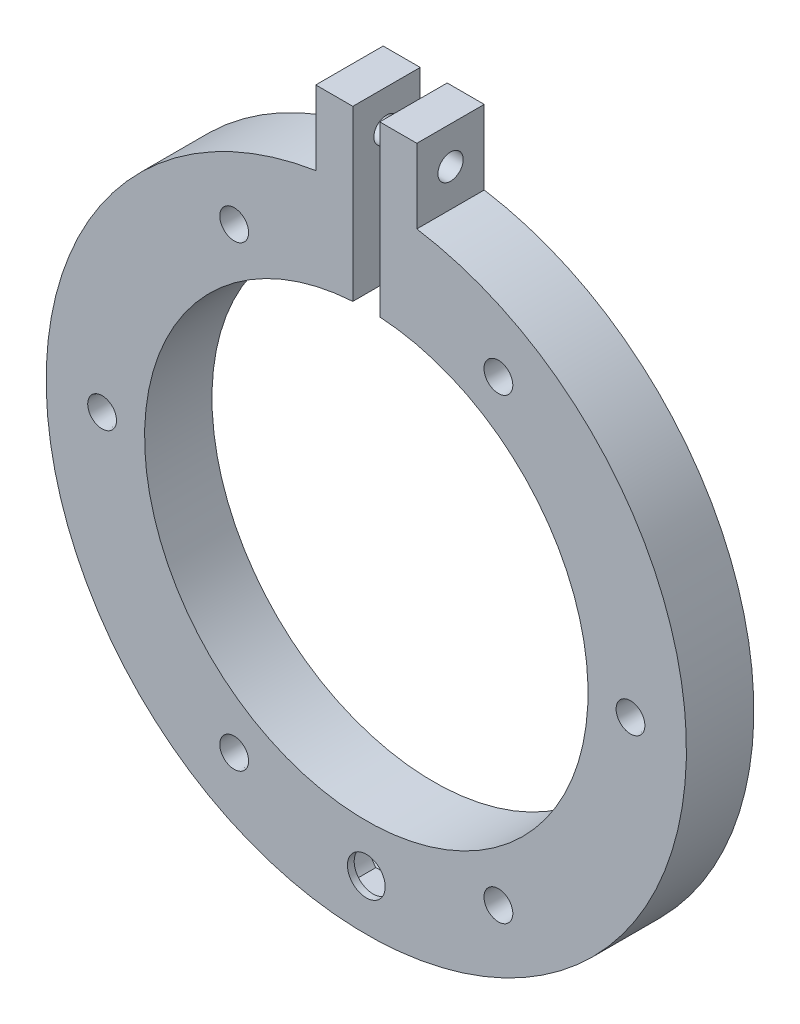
ISO-10303-21;
HEADER;
FILE_DESCRIPTION(('STEP AP214'),'2;1');
FILE_NAME('part.step','',(''),(''),'','','');
FILE_SCHEMA(('AUTOMOTIVE_DESIGN { 1 0 10303 214 1 1 1 1 }'));
ENDSEC;
DATA;
#1=APPLICATION_CONTEXT('core data for automotive mechanical design processes');
#2=APPLICATION_PROTOCOL_DEFINITION('international standard','automotive_design',2000,#1);
#3=PRODUCT_CONTEXT('',#1,'mechanical');
#4=PRODUCT('Part','Part','',(#3));
#5=PRODUCT_RELATED_PRODUCT_CATEGORY('part','',(#4));
#6=PRODUCT_DEFINITION_FORMATION('','',#4);
#7=PRODUCT_DEFINITION_CONTEXT('part definition',#1,'design');
#8=PRODUCT_DEFINITION('design','',#6,#7);
#9=PRODUCT_DEFINITION_SHAPE('','',#8);
#10=(LENGTH_UNIT() NAMED_UNIT(*) SI_UNIT(.MILLI.,.METRE.));
#11=(NAMED_UNIT(*) PLANE_ANGLE_UNIT() SI_UNIT($,.RADIAN.));
#12=(NAMED_UNIT(*) SI_UNIT($,.STERADIAN.) SOLID_ANGLE_UNIT());
#13=UNCERTAINTY_MEASURE_WITH_UNIT(LENGTH_MEASURE(1.E-05),#10,'distance_accuracy_value','');
#14=(GEOMETRIC_REPRESENTATION_CONTEXT(3) GLOBAL_UNCERTAINTY_ASSIGNED_CONTEXT((#13)) GLOBAL_UNIT_ASSIGNED_CONTEXT((#10,
#11,#12)) REPRESENTATION_CONTEXT('',''));
#15=CARTESIAN_POINT('',(0.,0.,0.));
#16=DIRECTION('',(0.,0.,1.));
#17=DIRECTION('',(1.,0.,0.));
#18=AXIS2_PLACEMENT_3D('',#15,#16,#17);
#19=CARTESIAN_POINT('',(0.,0.,12.7));
#20=DIRECTION('',(0.,0.,-1.));
#21=DIRECTION('',(-1.,0.,0.));
#22=AXIS2_PLACEMENT_3D('',#19,#20,#21);
#23=CYLINDRICAL_SURFACE('',#22,60.325);
#24=CARTESIAN_POINT('',(0.,0.,0.));
#25=DIRECTION('',(0.,0.,1.));
#26=DIRECTION('',(1.,0.,0.));
#27=AXIS2_PLACEMENT_3D('',#24,#25,#26);
#28=CIRCLE('',#27,60.325);
#29=CARTESIAN_POINT('',(-9.525,59.5682801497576,0.));
#30=VERTEX_POINT('',#29);
#31=CARTESIAN_POINT('',(9.525,59.5682801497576,0.));
#32=VERTEX_POINT('',#31);
#33=EDGE_CURVE('E297',#30,#32,#28,.T.);
#34=ORIENTED_EDGE('',*,*,#33,.T.);
#35=DIRECTION('',(0.,0.,-1.));
#36=VECTOR('',#35,1.);
#37=CARTESIAN_POINT('',(9.525,59.5682801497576,12.7));
#38=LINE('',#37,#36);
#39=CARTESIAN_POINT('',(9.525,59.5682801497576,12.7));
#40=VERTEX_POINT('',#39);
#41=EDGE_CURVE('E301',#32,#40,#38,.F.);
#42=ORIENTED_EDGE('',*,*,#41,.T.);
#43=CARTESIAN_POINT('',(0.,0.,12.7));
#44=DIRECTION('',(0.,0.,1.));
#45=DIRECTION('',(1.,0.,0.));
#46=AXIS2_PLACEMENT_3D('',#43,#44,#45);
#47=CIRCLE('',#46,60.325);
#48=CARTESIAN_POINT('',(-9.525,59.5682801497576,12.7));
#49=VERTEX_POINT('',#48);
#50=EDGE_CURVE('E307',#49,#40,#47,.T.);
#51=ORIENTED_EDGE('',*,*,#50,.F.);
#52=DIRECTION('',(0.,0.,-1.));
#53=VECTOR('',#52,1.);
#54=CARTESIAN_POINT('',(-9.525,59.5682801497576,12.7));
#55=LINE('',#54,#53);
#56=EDGE_CURVE('E304',#49,#30,#55,.T.);
#57=ORIENTED_EDGE('',*,*,#56,.T.);
#58=EDGE_LOOP('',(#34,#42,#51,#57));
#59=FACE_BOUND('',#58,.T.);
#60=CARTESIAN_POINT('',(0.,-60.325,1.00943066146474));
#61=CARTESIAN_POINT('',(0.142605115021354,-60.3249992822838,1.00943696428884));
#62=CARTESIAN_POINT('',(0.285312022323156,-60.3244889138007,1.02148056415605));
#63=CARTESIAN_POINT('',(0.566790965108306,-60.3225020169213,1.06935514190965));
#64=CARTESIAN_POINT('',(0.705558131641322,-60.3210243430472,1.10521432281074));
#65=CARTESIAN_POINT('',(0.97503923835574,-60.3172701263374,1.19969325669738));
#66=CARTESIAN_POINT('',(1.10575717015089,-60.3149939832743,1.25830162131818));
#67=CARTESIAN_POINT('',(1.35546341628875,-60.3098993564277,1.39659826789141));
#68=CARTESIAN_POINT('',(1.47445453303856,-60.3070810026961,1.47628149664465));
#69=CARTESIAN_POINT('',(1.69745564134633,-60.3012167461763,1.65453423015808));
#70=CARTESIAN_POINT('',(1.80145573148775,-60.2981706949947,1.75311611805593));
#71=CARTESIAN_POINT('',(1.99143852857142,-60.2921956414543,1.96634390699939));
#72=CARTESIAN_POINT('',(2.07742050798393,-60.2892666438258,2.08099045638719));
#73=CARTESIAN_POINT('',(2.22895045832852,-60.2838550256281,2.3231409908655));
#74=CARTESIAN_POINT('',(2.29449118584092,-60.2813725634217,2.4506495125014));
#75=CARTESIAN_POINT('',(2.40323155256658,-60.2771356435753,2.71487245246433));
#76=CARTESIAN_POINT('',(2.44643132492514,-60.2753811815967,2.85158681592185));
#77=CARTESIAN_POINT('',(2.50923866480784,-60.2727993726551,3.13025393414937));
#78=CARTESIAN_POINT('',(2.52886033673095,-60.2719714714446,3.27220350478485));
#79=CARTESIAN_POINT('',(2.54399798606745,-60.2713344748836,3.55738391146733));
#80=CARTESIAN_POINT('',(2.53951411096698,-60.2715253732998,3.70061473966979));
#81=CARTESIAN_POINT('',(2.50657974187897,-60.2729039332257,3.98419610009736));
#82=CARTESIAN_POINT('',(2.4781444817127,-60.2740909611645,4.12454840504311));
#83=CARTESIAN_POINT('',(2.39813810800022,-60.2773269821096,4.39848569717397));
#84=CARTESIAN_POINT('',(2.34656691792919,-60.2793759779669,4.53207066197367));
#85=CARTESIAN_POINT('',(2.22173515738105,-60.2841057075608,4.78873038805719));
#86=CARTESIAN_POINT('',(2.14846762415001,-60.2867866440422,4.91180175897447));
#87=CARTESIAN_POINT('',(1.98232807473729,-60.2924778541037,5.14390364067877));
#88=CARTESIAN_POINT('',(1.88945596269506,-60.295488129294,5.25293408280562));
#89=CARTESIAN_POINT('',(1.68665749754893,-60.3015015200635,5.4539478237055));
#90=CARTESIAN_POINT('',(1.57671794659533,-60.3045046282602,5.54591780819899));
#91=CARTESIAN_POINT('',(1.34295183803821,-60.3101629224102,5.71009739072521));
#92=CARTESIAN_POINT('',(1.21912527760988,-60.3128181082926,5.78230698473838));
#93=CARTESIAN_POINT('',(0.961092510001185,-60.3174813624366,5.90491465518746));
#94=CARTESIAN_POINT('',(0.826886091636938,-60.3194894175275,5.95531228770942));
#95=CARTESIAN_POINT('',(0.551906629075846,-60.322631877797,6.03285682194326));
#96=CARTESIAN_POINT('',(0.411133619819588,-60.3237662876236,6.06000384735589));
#97=CARTESIAN_POINT('',(0.127132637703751,-60.3250329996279,6.0902601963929));
#98=CARTESIAN_POINT('',(-0.0160933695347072,-60.3251660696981,6.09338793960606));
#99=CARTESIAN_POINT('',(-0.301036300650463,-60.3244171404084,6.07556497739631));
#100=CARTESIAN_POINT('',(-0.442753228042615,-60.3235351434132,6.05461432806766));
#101=CARTESIAN_POINT('',(-0.72060368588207,-60.3208559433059,5.98924453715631));
#102=CARTESIAN_POINT('',(-0.856739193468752,-60.319059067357,5.94483378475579));
#103=CARTESIAN_POINT('',(-1.11962324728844,-60.3147524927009,5.83381295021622));
#104=CARTESIAN_POINT('',(-1.24637175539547,-60.3122427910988,5.76720277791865));
#105=CARTESIAN_POINT('',(-1.48696856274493,-60.3067911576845,5.61362663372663));
#106=CARTESIAN_POINT('',(-1.60080895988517,-60.3038489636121,5.52664829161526));
#107=CARTESIAN_POINT('',(-1.81227862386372,-60.2978646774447,5.33482291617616));
#108=CARTESIAN_POINT('',(-1.90990781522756,-60.2948225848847,5.22997579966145));
#109=CARTESIAN_POINT('',(-2.08624552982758,-60.2889792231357,5.00530999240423));
#110=CARTESIAN_POINT('',(-2.1649421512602,-60.286178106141,4.8854819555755));
#111=CARTESIAN_POINT('',(-2.30109948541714,-60.2811349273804,4.63430317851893));
#112=CARTESIAN_POINT('',(-2.35856027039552,-60.2788928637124,4.50295247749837));
#113=CARTESIAN_POINT('',(-2.45059401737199,-60.2752216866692,4.23250135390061));
#114=CARTESIAN_POINT('',(-2.48517461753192,-60.2737923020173,4.09340353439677));
#115=CARTESIAN_POINT('',(-2.53049138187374,-60.2719068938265,3.81137005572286));
#116=CARTESIAN_POINT('',(-2.54122762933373,-60.2714508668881,3.66843440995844));
#117=CARTESIAN_POINT('',(-2.53855005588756,-60.2715636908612,3.38290133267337));
#118=CARTESIAN_POINT('',(-2.52515497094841,-60.2721317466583,3.24030372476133));
#119=CARTESIAN_POINT('',(-2.47463362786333,-60.2742270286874,2.95938355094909));
#120=CARTESIAN_POINT('',(-2.43750732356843,-60.2757542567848,2.82106099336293));
#121=CARTESIAN_POINT('',(-2.3405809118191,-60.2795955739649,2.55261256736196));
#122=CARTESIAN_POINT('',(-2.28078052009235,-60.2819096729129,2.42248680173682));
#123=CARTESIAN_POINT('',(-2.14020742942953,-60.2870638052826,2.17412242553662));
#124=CARTESIAN_POINT('',(-2.05943542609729,-60.2899038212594,2.05588342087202));
#125=CARTESIAN_POINT('',(-1.87914753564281,-60.2957921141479,1.83455706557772));
#126=CARTESIAN_POINT('',(-1.77961915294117,-60.2988405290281,1.73147989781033));
#127=CARTESIAN_POINT('',(-1.56464135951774,-60.3048012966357,1.54346698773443));
#128=CARTESIAN_POINT('',(-1.44918802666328,-60.3077136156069,1.45853572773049));
#129=CARTESIAN_POINT('',(-1.20556779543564,-60.3130755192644,1.30919738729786));
#130=CARTESIAN_POINT('',(-1.07739059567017,-60.3155247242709,1.24480711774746));
#131=CARTESIAN_POINT('',(-0.812131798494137,-60.3196782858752,1.13853671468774));
#132=CARTESIAN_POINT('',(-0.67506098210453,-60.3213835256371,1.09662987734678));
#133=CARTESIAN_POINT('',(-0.447609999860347,-60.3234038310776,1.04755982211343));
#134=CARTESIAN_POINT('',(-0.358704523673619,-60.3239997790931,1.03327952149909));
#135=CARTESIAN_POINT('',(-0.179879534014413,-60.324798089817,1.01421295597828));
#136=CARTESIAN_POINT('',(-0.08996002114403,-60.3250004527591,1.00942668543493));
#137=CARTESIAN_POINT('',(0.,-60.325,1.00943066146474));
#138=B_SPLINE_CURVE_WITH_KNOTS('',3,(#60,#61,#62,#63,#64,#65,#66,#67,#68,#69,#70,#71,#72,#73,
#74,#75,#76,#77,#78,#79,#80,#81,#82,#83,#84,#85,#86,#87,#88,#89,#90,#91,#92,#93,#94,#95,#96,#97,
#98,#99,#100,#101,#102,#103,#104,#105,#106,#107,#108,#109,#110,#111,#112,#113,#114,#115,#116,
#117,#118,#119,#120,#121,#122,#123,#124,#125,#126,#127,#128,#129,#130,#131,#132,#133,#134,#135,
#136,#137),.UNSPECIFIED.,.T.,.F.,(4,2,2,2,2,2,2,2,2,2,2,2,2,2,2,2,2,2,2,2,2,2,2,2,2,2,2,2,2,2,2,
2,2,2,2,2,2,2,4),(0.,0.427486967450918,0.855481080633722,1.283261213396,1.71093886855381,
2.13889771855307,2.56687384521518,2.99500145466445,3.42312651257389,3.85099533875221,
4.27886154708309,4.70645582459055,5.13405151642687,5.56178458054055,5.98951973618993,
6.41758731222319,6.84565497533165,7.27373135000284,7.70180544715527,8.12955123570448,
8.55729602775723,8.98488796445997,9.41248163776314,9.84033567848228,10.2681917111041,
10.6963160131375,11.1244388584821,11.5524187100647,11.9803970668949,12.4080432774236,
12.835690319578,13.263342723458,13.6909809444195,14.1189050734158,14.5469347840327,
14.9753139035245,15.4031830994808,15.672856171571,15.9425290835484),.UNSPECIFIED.);
#139=CARTESIAN_POINT('',(0.,-60.325,1.00943066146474));
#140=VERTEX_POINT('',#139);
#141=EDGE_CURVE('E195',#140,#140,#138,.T.);
#142=ORIENTED_EDGE('',*,*,#141,.F.);
#143=EDGE_LOOP('',(#142));
#144=FACE_BOUND('',#143,.T.);
#145=ADVANCED_FACE('F35',(#59,#144),#23,.T.);
#146=CARTESIAN_POINT('',(0.,0.,6.35));
#147=DIRECTION('',(0.,0.,-1.));
#148=DIRECTION('',(-1.,0.,0.));
#149=AXIS2_PLACEMENT_3D('',#146,#147,#148);
#150=CYLINDRICAL_SURFACE('',#149,57.15);
#151=CARTESIAN_POINT('',(0.,0.,6.35));
#152=DIRECTION('',(0.,0.,-1.));
#153=DIRECTION('',(-1.,0.,0.));
#154=AXIS2_PLACEMENT_3D('',#151,#152,#153);
#155=CIRCLE('',#154,57.15);
#156=CARTESIAN_POINT('',(2.54,57.0935276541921,6.35));
#157=VERTEX_POINT('',#156);
#158=CARTESIAN_POINT('',(-2.54,57.0935276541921,6.35));
#159=VERTEX_POINT('',#158);
#160=EDGE_CURVE('E380',#157,#159,#155,.T.);
#161=ORIENTED_EDGE('',*,*,#160,.F.);
#162=DIRECTION('',(0.,0.,-1.));
#163=VECTOR('',#162,1.);
#164=CARTESIAN_POINT('',(2.54,57.0935276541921,6.35));
#165=LINE('',#164,#163);
#166=CARTESIAN_POINT('',(2.54,57.0935276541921,0.));
#167=VERTEX_POINT('',#166);
#168=EDGE_CURVE('E11',#167,#157,#165,.F.);
#169=ORIENTED_EDGE('',*,*,#168,.F.);
#170=CARTESIAN_POINT('',(0.,0.,0.));
#171=DIRECTION('',(0.,0.,-1.));
#172=DIRECTION('',(-1.,0.,0.));
#173=AXIS2_PLACEMENT_3D('',#170,#171,#172);
#174=CIRCLE('',#173,57.15);
#175=CARTESIAN_POINT('',(-2.54,57.0935276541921,0.));
#176=VERTEX_POINT('',#175);
#177=EDGE_CURVE('E390',#167,#176,#174,.T.);
#178=ORIENTED_EDGE('',*,*,#177,.T.);
#179=DIRECTION('',(0.,0.,-1.));
#180=VECTOR('',#179,1.);
#181=CARTESIAN_POINT('',(-2.54,57.0935276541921,6.35));
#182=LINE('',#181,#180);
#183=EDGE_CURVE('E388',#159,#176,#182,.T.);
#184=ORIENTED_EDGE('',*,*,#183,.F.);
#185=EDGE_LOOP('',(#161,#169,#178,#184));
#186=FACE_BOUND('',#185,.T.);
#187=CARTESIAN_POINT('',(0.,-57.15,1.00943066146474));
#188=CARTESIAN_POINT('',(-0.142597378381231,-57.1499992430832,1.0094369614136));
#189=CARTESIAN_POINT('',(-0.285296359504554,-57.1494605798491,1.02147925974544));
#190=CARTESIAN_POINT('',(-0.566759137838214,-57.1473635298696,1.06934836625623));
#191=CARTESIAN_POINT('',(-0.705518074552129,-57.1458039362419,1.1052033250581));
#192=CARTESIAN_POINT('',(-0.974982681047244,-57.1418415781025,1.19967038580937));
#193=CARTESIAN_POINT('',(-1.10569236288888,-57.1394392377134,1.25827104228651));
#194=CARTESIAN_POINT('',(-1.3553837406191,-57.1340620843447,1.39654883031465));
#195=CARTESIAN_POINT('',(-1.47436822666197,-57.1310874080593,1.47622093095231));
#196=CARTESIAN_POINT('',(-1.69736607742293,-57.1248975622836,1.65445421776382));
#197=CARTESIAN_POINT('',(-1.80136859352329,-57.1216822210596,1.75302897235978));
#198=CARTESIAN_POINT('',(-1.99135802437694,-57.1153749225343,1.96624290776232));
#199=CARTESIAN_POINT('',(-2.07734420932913,-57.1122829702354,2.08088273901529));
#200=CARTESIAN_POINT('',(-2.22888772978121,-57.1065699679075,2.32302654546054));
#201=CARTESIAN_POINT('',(-2.29443694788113,-57.1039491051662,2.450535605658));
#202=CARTESIAN_POINT('',(-2.40319364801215,-57.0994758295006,2.71476248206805));
#203=CARTESIAN_POINT('',(-2.44640127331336,-57.0976234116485,2.8514802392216));
#204=CARTESIAN_POINT('',(-2.50922058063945,-57.0948974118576,3.13014697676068));
#205=CARTESIAN_POINT('',(-2.52884798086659,-57.0940231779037,3.27209240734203));
#206=CARTESIAN_POINT('',(-2.54399816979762,-57.0933501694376,3.5572657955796));
#207=CARTESIAN_POINT('',(-2.53952111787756,-57.0935513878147,3.7004937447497));
#208=CARTESIAN_POINT('',(-2.50660261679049,-57.0950059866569,3.98405970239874));
#209=CARTESIAN_POINT('',(-2.47817814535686,-57.0962586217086,4.12439968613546));
#210=CARTESIAN_POINT('',(-2.39819797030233,-57.0996736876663,4.39831414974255));
#211=CARTESIAN_POINT('',(-2.34664218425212,-57.1018361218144,4.53188860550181));
#212=CARTESIAN_POINT('',(-2.22184343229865,-57.1068279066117,4.78853504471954));
#213=CARTESIAN_POINT('',(-2.14859271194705,-57.1096574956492,4.91160325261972));
#214=CARTESIAN_POINT('',(-1.98248908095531,-57.1156644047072,5.14370242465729));
#215=CARTESIAN_POINT('',(-1.88963606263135,-57.1188417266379,5.25273331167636));
#216=CARTESIAN_POINT('',(-1.68686771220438,-57.1251892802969,5.4537616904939));
#217=CARTESIAN_POINT('',(-1.57693767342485,-57.1283595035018,5.54574434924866));
#218=CARTESIAN_POINT('',(-1.34318753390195,-57.1343328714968,5.70995095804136));
#219=CARTESIAN_POINT('',(-1.2193674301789,-57.1371360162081,5.78217490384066));
#220=CARTESIAN_POINT('',(-0.961343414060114,-57.1420593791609,5.9048124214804));
#221=CARTESIAN_POINT('',(-0.827139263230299,-57.1441795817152,5.95522549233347));
#222=CARTESIAN_POINT('',(-0.552160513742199,-57.1474978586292,6.03280059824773));
#223=CARTESIAN_POINT('',(-0.411385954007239,-57.1486959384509,6.0599627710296));
#224=CARTESIAN_POINT('',(-0.12739126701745,-57.1500342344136,6.09024679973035));
#225=CARTESIAN_POINT('',(0.0158266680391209,-57.1501753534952,6.09338917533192));
#226=CARTESIAN_POINT('',(0.300755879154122,-57.1493862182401,6.07559793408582));
#227=CARTESIAN_POINT('',(0.442467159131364,-57.1484559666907,6.05466437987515));
#228=CARTESIAN_POINT('',(0.720302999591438,-57.1456294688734,5.989332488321));
#229=CARTESIAN_POINT('',(0.856429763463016,-57.1437336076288,5.94494350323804));
#230=CARTESIAN_POINT('',(1.11930024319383,-57.1391893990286,5.83397027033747));
#231=CARTESIAN_POINT('',(1.24604391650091,-57.1365410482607,5.76738592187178));
#232=CARTESIAN_POINT('',(1.48664472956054,-57.1307876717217,5.6138594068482));
#233=CARTESIAN_POINT('',(1.60049307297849,-57.1276823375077,5.52690346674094));
#234=CARTESIAN_POINT('',(1.81198308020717,-57.121365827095,5.33512228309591));
#235=CARTESIAN_POINT('',(1.90962466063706,-57.1181546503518,5.23029694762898));
#236=CARTESIAN_POINT('',(2.0859983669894,-57.111985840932,5.00566441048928));
#237=CARTESIAN_POINT('',(2.16471722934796,-57.1090283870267,4.88584678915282));
#238=CARTESIAN_POINT('',(2.30092032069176,-57.1037033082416,4.63468364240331));
#239=CARTESIAN_POINT('',(2.35840462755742,-57.1013356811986,4.50333815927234));
#240=CARTESIAN_POINT('',(2.45048366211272,-57.0974585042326,4.23289710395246));
#241=CARTESIAN_POINT('',(2.48508688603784,-57.0959486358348,4.09380442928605));
#242=CARTESIAN_POINT('',(2.53044930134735,-57.0939563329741,3.81177664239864));
#243=CARTESIAN_POINT('',(2.54120859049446,-57.0934738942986,3.66884154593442));
#244=CARTESIAN_POINT('',(2.53857673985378,-57.0935909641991,3.38331846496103));
#245=CARTESIAN_POINT('',(2.52520647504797,-57.0941895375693,3.24073028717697));
#246=CARTESIAN_POINT('',(2.47473814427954,-57.0963991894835,2.95982496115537));
#247=CARTESIAN_POINT('',(2.43764003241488,-57.0980102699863,2.82150782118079));
#248=CARTESIAN_POINT('',(2.34077309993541,-57.1020631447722,2.55306584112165));
#249=CARTESIAN_POINT('',(2.28100402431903,-57.1045049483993,2.4229410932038));
#250=CARTESIAN_POINT('',(2.14049593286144,-57.1099439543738,2.17457296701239));
#251=CARTESIAN_POINT('',(2.05975759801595,-57.1129411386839,2.05632920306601));
#252=CARTESIAN_POINT('',(1.87953003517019,-57.1191559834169,1.83497651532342));
#253=CARTESIAN_POINT('',(1.78002666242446,-57.1223738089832,1.73187911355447));
#254=CARTESIAN_POINT('',(1.56509520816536,-57.1286662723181,1.54382125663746));
#255=CARTESIAN_POINT('',(1.44966320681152,-57.1317408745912,1.45886527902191));
#256=CARTESIAN_POINT('',(1.2060755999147,-57.137402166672,1.30947050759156));
#257=CARTESIAN_POINT('',(1.07790919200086,-57.1399884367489,1.2450493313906));
#258=CARTESIAN_POINT('',(0.812665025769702,-57.1443750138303,1.13871610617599));
#259=CARTESIAN_POINT('',(0.675598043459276,-57.1461762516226,1.09677738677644));
#260=CARTESIAN_POINT('',(0.448062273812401,-57.1483117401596,1.04763749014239));
#261=CARTESIAN_POINT('',(0.359068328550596,-57.1489420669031,1.03332813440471));
#262=CARTESIAN_POINT('',(0.180063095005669,-57.1497864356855,1.01422273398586));
#263=CARTESIAN_POINT('',(0.090051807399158,-57.1500004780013,1.00942668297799));
#264=CARTESIAN_POINT('',(0.,-57.15,1.00943066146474));
#265=B_SPLINE_CURVE_WITH_KNOTS('',3,(#187,#188,#189,#190,#191,#192,#193,#194,#195,#196,#197,
#198,#199,#200,#201,#202,#203,#204,#205,#206,#207,#208,#209,#210,#211,#212,#213,#214,#215,#216,
#217,#218,#219,#220,#221,#222,#223,#224,#225,#226,#227,#228,#229,#230,#231,#232,#233,#234,#235,
#236,#237,#238,#239,#240,#241,#242,#243,#244,#245,#246,#247,#248,#249,#250,#251,#252,#253,#254,
#255,#256,#257,#258,#259,#260,#261,#262,#263,#264),.UNSPECIFIED.,.T.,.F.,(4,2,2,2,2,2,2,2,2,2,2,
2,2,2,2,2,2,2,2,2,2,2,2,2,2,2,2,2,2,2,2,2,2,2,2,2,2,2,4),(0.,0.427463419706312,
0.855433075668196,1.28318765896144,1.71084020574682,2.13880088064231,2.56677888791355,
2.99492666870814,3.4230717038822,3.85093118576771,4.27878783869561,4.70634141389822,
5.13389651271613,5.56160461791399,5.98931507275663,6.41739593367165,6.84547688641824,
7.27356767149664,7.70165592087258,8.12937842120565,8.5570998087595,8.98465078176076,
9.41220369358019,9.84004651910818,10.2678915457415,10.6960355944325,11.1241780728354,
11.5521614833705,11.9801431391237,12.4077547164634,12.8353671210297,13.262984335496,
13.6905876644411,14.1185146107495,14.5465470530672,14.974945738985,15.4028350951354,
15.672783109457,15.9427309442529),.UNSPECIFIED.);
#266=CARTESIAN_POINT('',(0.,-57.15,1.00943066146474));
#267=VERTEX_POINT('',#266);
#268=EDGE_CURVE('E39',#267,#267,#265,.T.);
#269=ORIENTED_EDGE('',*,*,#268,.F.);
#270=EDGE_LOOP('',(#269));
#271=FACE_BOUND('',#270,.T.);
#272=ADVANCED_FACE('F241',(#186,#271),#150,.F.);
#273=CARTESIAN_POINT('',(0.,0.,0.));
#274=DIRECTION('',(0.,0.,1.));
#275=DIRECTION('',(1.,0.,0.));
#276=AXIS2_PLACEMENT_3D('',#273,#274,#275);
#277=PLANE('',#276);
#278=CARTESIAN_POINT('',(0.,0.,0.));
#279=DIRECTION('',(0.,0.,-1.));
#280=DIRECTION('',(-1.,0.,0.));
#281=AXIS2_PLACEMENT_3D('',#278,#279,#280);
#282=CIRCLE('',#281,44.45);
#283=CARTESIAN_POINT('',(2.54,44.3773692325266,0.));
#284=VERTEX_POINT('',#283);
#285=CARTESIAN_POINT('',(-2.54,44.3773692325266,0.));
#286=VERTEX_POINT('',#285);
#287=EDGE_CURVE('E63',#284,#286,#282,.T.);
#288=ORIENTED_EDGE('',*,*,#287,.T.);
#289=DIRECTION('',(0.,1.,0.));
#290=VECTOR('',#289,1.);
#291=CARTESIAN_POINT('',(-2.54,37.5679616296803,0.));
#292=LINE('',#291,#290);
#293=CARTESIAN_POINT('',(-2.54,41.7057248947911,0.));
#294=VERTEX_POINT('',#293);
#295=EDGE_CURVE('E357',#294,#286,#292,.T.);
#296=ORIENTED_EDGE('',*,*,#295,.F.);
#297=CARTESIAN_POINT('',(0.,0.,0.));
#298=DIRECTION('',(0.,0.,1.));
#299=DIRECTION('',(1.,0.,0.));
#300=AXIS2_PLACEMENT_3D('',#297,#298,#299);
#301=CIRCLE('',#300,41.783);
#302=CARTESIAN_POINT('',(2.54,41.7057248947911,0.));
#303=VERTEX_POINT('',#302);
#304=EDGE_CURVE('E356',#294,#303,#301,.T.);
#305=ORIENTED_EDGE('',*,*,#304,.T.);
#306=DIRECTION('',(0.,-1.,0.));
#307=VECTOR('',#306,1.);
#308=CARTESIAN_POINT('',(2.54,37.5679616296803,0.));
#309=LINE('',#308,#307);
#310=EDGE_CURVE('E360',#284,#303,#309,.T.);
#311=ORIENTED_EDGE('',*,*,#310,.F.);
#312=EDGE_LOOP('',(#288,#296,#305,#311));
#313=FACE_BOUND('',#312,.T.);
#314=ADVANCED_FACE('F245',(#313),#277,.F.);
#315=CARTESIAN_POINT('',(0.,0.,12.7));
#316=DIRECTION('',(0.,0.,1.));
#317=DIRECTION('',(1.,0.,0.));
#318=AXIS2_PLACEMENT_3D('',#315,#316,#317);
#319=PLANE('',#318);
#320=CARTESIAN_POINT('',(0.,-50.8,12.7));
#321=DIRECTION('',(0.,0.,-1.));
#322=DIRECTION('',(-1.,0.,0.));
#323=AXIS2_PLACEMENT_3D('',#320,#321,#322);
#324=CIRCLE('',#323,3.556);
#325=CARTESIAN_POINT('',(-3.556,-50.8,12.7));
#326=VERTEX_POINT('',#325);
#327=EDGE_CURVE('E186',#326,#326,#324,.T.);
#328=ORIENTED_EDGE('',*,*,#327,.T.);
#329=EDGE_LOOP('',(#328));
#330=FACE_BOUND('',#329,.T.);
#331=CARTESIAN_POINT('',(49.7839999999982,-1.16503095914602E-12,12.7));
#332=DIRECTION('',(0.,0.,-1.));
#333=DIRECTION('',(-1.,0.,0.));
#334=AXIS2_PLACEMENT_3D('',#331,#332,#333);
#335=CIRCLE('',#334,2.71403939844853);
#336=CARTESIAN_POINT('',(47.0699606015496,-1.16503095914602E-12,12.7));
#337=VERTEX_POINT('',#336);
#338=EDGE_CURVE('E459',#337,#337,#335,.T.);
#339=ORIENTED_EDGE('',*,*,#338,.T.);
#340=EDGE_LOOP('',(#339));
#341=FACE_BOUND('',#340,.T.);
#342=CARTESIAN_POINT('',(24.8919999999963,-43.1142087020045,12.7));
#343=DIRECTION('',(0.,0.,-1.));
#344=DIRECTION('',(-1.,0.,0.));
#345=AXIS2_PLACEMENT_3D('',#342,#343,#344);
#346=CIRCLE('',#345,2.71403939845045);
#347=CARTESIAN_POINT('',(22.1779606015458,-43.1142087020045,12.7));
#348=VERTEX_POINT('',#347);
#349=EDGE_CURVE('E454',#348,#348,#346,.T.);
#350=ORIENTED_EDGE('',*,*,#349,.T.);
#351=EDGE_LOOP('',(#350));
#352=FACE_BOUND('',#351,.T.);
#353=CARTESIAN_POINT('',(-24.8920000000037,-43.1142087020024,12.7));
#354=DIRECTION('',(0.,0.,-1.));
#355=DIRECTION('',(-1.,0.,0.));
#356=AXIS2_PLACEMENT_3D('',#353,#354,#355);
#357=CIRCLE('',#356,2.71403939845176);
#358=CARTESIAN_POINT('',(-27.6060393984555,-43.1142087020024,12.7));
#359=VERTEX_POINT('',#358);
#360=EDGE_CURVE('E448',#359,#359,#357,.T.);
#361=ORIENTED_EDGE('',*,*,#360,.T.);
#362=EDGE_LOOP('',(#361));
#363=FACE_BOUND('',#362,.T.);
#364=CARTESIAN_POINT('',(-49.7840000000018,3.23282134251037E-12,12.7));
#365=DIRECTION('',(0.,0.,-1.));
#366=DIRECTION('',(-1.,0.,0.));
#367=AXIS2_PLACEMENT_3D('',#364,#365,#366);
#368=CIRCLE('',#367,2.71403939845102);
#369=CARTESIAN_POINT('',(-52.4980393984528,3.23282134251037E-12,12.7));
#370=VERTEX_POINT('',#369);
#371=EDGE_CURVE('E442',#370,#370,#368,.T.);
#372=ORIENTED_EDGE('',*,*,#371,.T.);
#373=EDGE_LOOP('',(#372));
#374=FACE_BOUND('',#373,.T.);
#375=CARTESIAN_POINT('',(-24.8919999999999,43.1142087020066,12.7));
#376=DIRECTION('',(0.,0.,-1.));
#377=DIRECTION('',(-1.,0.,0.));
#378=AXIS2_PLACEMENT_3D('',#375,#376,#377);
#379=CIRCLE('',#378,2.71403939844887);
#380=CARTESIAN_POINT('',(-27.6060393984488,43.1142087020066,12.7));
#381=VERTEX_POINT('',#380);
#382=EDGE_CURVE('E436',#381,#381,#379,.T.);
#383=ORIENTED_EDGE('',*,*,#382,.T.);
#384=EDGE_LOOP('',(#383));
#385=FACE_BOUND('',#384,.T.);
#386=CARTESIAN_POINT('',(24.8920000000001,43.1142087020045,12.7));
#387=DIRECTION('',(0.,0.,-1.));
#388=DIRECTION('',(-1.,0.,0.));
#389=AXIS2_PLACEMENT_3D('',#386,#387,#388);
#390=CIRCLE('',#389,2.71403939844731);
#391=CARTESIAN_POINT('',(22.1779606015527,43.1142087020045,12.7));
#392=VERTEX_POINT('',#391);
#393=EDGE_CURVE('E429',#392,#392,#390,.T.);
#394=ORIENTED_EDGE('',*,*,#393,.T.);
#395=EDGE_LOOP('',(#394));
#396=FACE_BOUND('',#395,.T.);
#397=DIRECTION('',(0.,-1.,0.));
#398=VECTOR('',#397,1.);
#399=CARTESIAN_POINT('',(2.54,37.5679616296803,12.7));
#400=LINE('',#399,#398);
#401=CARTESIAN_POINT('',(2.54,73.5440140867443,12.7));
#402=VERTEX_POINT('',#401);
#403=CARTESIAN_POINT('',(2.54,41.7057248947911,12.7));
#404=VERTEX_POINT('',#403);
#405=EDGE_CURVE('E353',#402,#404,#400,.T.);
#406=ORIENTED_EDGE('',*,*,#405,.T.);
#407=CARTESIAN_POINT('',(0.,0.,12.7));
#408=DIRECTION('',(0.,0.,1.));
#409=DIRECTION('',(1.,0.,0.));
#410=AXIS2_PLACEMENT_3D('',#407,#408,#409);
#411=CIRCLE('',#410,41.783);
#412=CARTESIAN_POINT('',(-2.54,41.7057248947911,12.7));
#413=VERTEX_POINT('',#412);
#414=EDGE_CURVE('E308',#413,#404,#411,.T.);
#415=ORIENTED_EDGE('',*,*,#414,.F.);
#416=DIRECTION('',(0.,1.,0.));
#417=VECTOR('',#416,1.);
#418=CARTESIAN_POINT('',(-2.54,37.5679616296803,12.7));
#419=LINE('',#418,#417);
#420=CARTESIAN_POINT('',(-2.54,73.5440140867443,12.7));
#421=VERTEX_POINT('',#420);
#422=EDGE_CURVE('E351',#413,#421,#419,.T.);
#423=ORIENTED_EDGE('',*,*,#422,.T.);
#424=DIRECTION('',(1.,0.,0.));
#425=VECTOR('',#424,1.);
#426=CARTESIAN_POINT('',(-2.54,73.5440140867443,12.7));
#427=LINE('',#426,#425);
#428=CARTESIAN_POINT('',(-9.525,73.5440140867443,12.7));
#429=VERTEX_POINT('',#428);
#430=EDGE_CURVE('E337',#429,#421,#427,.T.);
#431=ORIENTED_EDGE('',*,*,#430,.F.);
#432=DIRECTION('',(0.,1.,0.));
#433=VECTOR('',#432,1.);
#434=CARTESIAN_POINT('',(-9.525,53.1974838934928,12.7));
#435=LINE('',#434,#433);
#436=EDGE_CURVE('E335',#49,#429,#435,.T.);
#437=ORIENTED_EDGE('',*,*,#436,.F.);
#438=ORIENTED_EDGE('',*,*,#50,.T.);
#439=DIRECTION('',(0.,-1.,0.));
#440=VECTOR('',#439,1.);
#441=CARTESIAN_POINT('',(9.525,53.1974838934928,12.7));
#442=LINE('',#441,#440);
#443=CARTESIAN_POINT('',(9.525,73.5440140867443,12.7));
#444=VERTEX_POINT('',#443);
#445=EDGE_CURVE('E316',#444,#40,#442,.T.);
#446=ORIENTED_EDGE('',*,*,#445,.F.);
#447=DIRECTION('',(1.,0.,0.));
#448=VECTOR('',#447,1.);
#449=CARTESIAN_POINT('',(9.525,73.5440140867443,12.7));
#450=LINE('',#449,#448);
#451=EDGE_CURVE('E321',#402,#444,#450,.T.);
#452=ORIENTED_EDGE('',*,*,#451,.F.);
#453=EDGE_LOOP('',(#406,#415,#423,#431,#437,#438,#446,#452));
#454=FACE_BOUND('',#453,.T.);
#455=ADVANCED_FACE('F280',(#330,#341,#352,#363,#374,#385,#396,#454),#319,.T.);
#456=CARTESIAN_POINT('',(-2.54,73.5440140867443,0.));
#457=VERTEX_POINT('',#456);
#458=EDGE_CURVE('E348',#176,#457,#292,.T.);
#459=ORIENTED_EDGE('',*,*,#458,.F.);
#460=ORIENTED_EDGE('',*,*,#177,.F.);
#461=CARTESIAN_POINT('',(2.54,73.5440140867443,0.));
#462=VERTEX_POINT('',#461);
#463=EDGE_CURVE('E354',#462,#167,#309,.T.);
#464=ORIENTED_EDGE('',*,*,#463,.F.);
#465=DIRECTION('',(1.,0.,0.));
#466=VECTOR('',#465,1.);
#467=CARTESIAN_POINT('',(9.525,73.5440140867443,0.));
#468=LINE('',#467,#466);
#469=CARTESIAN_POINT('',(9.525,73.5440140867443,0.));
#470=VERTEX_POINT('',#469);
#471=EDGE_CURVE('E320',#462,#470,#468,.T.);
#472=ORIENTED_EDGE('',*,*,#471,.T.);
#473=DIRECTION('',(0.,-1.,0.));
#474=VECTOR('',#473,1.);
#475=CARTESIAN_POINT('',(9.525,53.1974838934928,0.));
#476=LINE('',#475,#474);
#477=EDGE_CURVE('E313',#470,#32,#476,.T.);
#478=ORIENTED_EDGE('',*,*,#477,.T.);
#479=ORIENTED_EDGE('',*,*,#33,.F.);
#480=DIRECTION('',(0.,1.,0.));
#481=VECTOR('',#480,1.);
#482=CARTESIAN_POINT('',(-9.525,53.1974838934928,0.));
#483=LINE('',#482,#481);
#484=CARTESIAN_POINT('',(-9.525,73.5440140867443,0.));
#485=VERTEX_POINT('',#484);
#486=EDGE_CURVE('E332',#30,#485,#483,.T.);
#487=ORIENTED_EDGE('',*,*,#486,.T.);
#488=DIRECTION('',(1.,0.,0.));
#489=VECTOR('',#488,1.);
#490=CARTESIAN_POINT('',(-2.54,73.5440140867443,0.));
#491=LINE('',#490,#489);
#492=EDGE_CURVE('E338',#485,#457,#491,.T.);
#493=ORIENTED_EDGE('',*,*,#492,.T.);
#494=EDGE_LOOP('',(#459,#460,#464,#472,#478,#479,#487,#493));
#495=FACE_BOUND('',#494,.T.);
#496=ADVANCED_FACE('F278',(#495),#277,.F.);
#497=CARTESIAN_POINT('',(0.,0.,12.7));
#498=DIRECTION('',(0.,0.,-1.));
#499=DIRECTION('',(-1.,0.,0.));
#500=AXIS2_PLACEMENT_3D('',#497,#498,#499);
#501=CYLINDRICAL_SURFACE('',#500,41.783);
#502=DIRECTION('',(0.,0.,-1.));
#503=VECTOR('',#502,1.);
#504=CARTESIAN_POINT('',(2.54,41.7057248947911,12.7));
#505=LINE('',#504,#503);
#506=EDGE_CURVE('E370',#303,#404,#505,.F.);
#507=ORIENTED_EDGE('',*,*,#506,.F.);
#508=ORIENTED_EDGE('',*,*,#304,.F.);
#509=DIRECTION('',(0.,0.,-1.));
#510=VECTOR('',#509,1.);
#511=CARTESIAN_POINT('',(-2.54,41.7057248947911,12.7));
#512=LINE('',#511,#510);
#513=EDGE_CURVE('E367',#413,#294,#512,.T.);
#514=ORIENTED_EDGE('',*,*,#513,.F.);
#515=ORIENTED_EDGE('',*,*,#414,.T.);
#516=EDGE_LOOP('',(#507,#508,#514,#515));
#517=FACE_BOUND('',#516,.T.);
#518=ADVANCED_FACE('F274',(#517),#501,.F.);
#519=CARTESIAN_POINT('',(-2.54,37.5679616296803,12.7));
#520=DIRECTION('',(-1.,0.,0.));
#521=DIRECTION('',(0.,0.,1.));
#522=AXIS2_PLACEMENT_3D('',#519,#520,#521);
#523=PLANE('',#522);
#524=CARTESIAN_POINT('',(-2.54,66.5561471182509,6.35));
#525=DIRECTION('',(-1.,0.,0.));
#526=DIRECTION('',(0.,0.,1.));
#527=AXIS2_PLACEMENT_3D('',#524,#525,#526);
#528=CIRCLE('',#527,2.38125);
#529=CARTESIAN_POINT('',(-2.54,66.5561471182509,8.73125));
#530=VERTEX_POINT('',#529);
#531=EDGE_CURVE('E325',#530,#530,#528,.T.);
#532=ORIENTED_EDGE('',*,*,#531,.T.);
#533=EDGE_LOOP('',(#532));
#534=FACE_BOUND('',#533,.T.);
#535=DIRECTION('',(0.,-1.,0.));
#536=VECTOR('',#535,1.);
#537=CARTESIAN_POINT('',(-2.54,37.5679616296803,6.35));
#538=LINE('',#537,#536);
#539=CARTESIAN_POINT('',(-2.54,44.3773692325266,6.35));
#540=VERTEX_POINT('',#539);
#541=EDGE_CURVE('E398',#159,#540,#538,.T.);
#542=ORIENTED_EDGE('',*,*,#541,.F.);
#543=ORIENTED_EDGE('',*,*,#183,.T.);
#544=ORIENTED_EDGE('',*,*,#458,.T.);
#545=DIRECTION('',(0.,0.,-1.));
#546=VECTOR('',#545,1.);
#547=CARTESIAN_POINT('',(-2.54,73.5440140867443,12.7));
#548=LINE('',#547,#546);
#549=EDGE_CURVE('E345',#421,#457,#548,.T.);
#550=ORIENTED_EDGE('',*,*,#549,.F.);
#551=ORIENTED_EDGE('',*,*,#422,.F.);
#552=ORIENTED_EDGE('',*,*,#513,.T.);
#553=ORIENTED_EDGE('',*,*,#295,.T.);
#554=DIRECTION('',(0.,0.,-1.));
#555=VECTOR('',#554,1.);
#556=CARTESIAN_POINT('',(-2.54,44.3773692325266,6.35));
#557=LINE('',#556,#555);
#558=EDGE_CURVE('E389',#540,#286,#557,.T.);
#559=ORIENTED_EDGE('',*,*,#558,.F.);
#560=EDGE_LOOP('',(#542,#543,#544,#550,#551,#552,#553,#559));
#561=FACE_BOUND('',#560,.T.);
#562=ADVANCED_FACE('F270',(#534,#561),#523,.F.);
#563=CARTESIAN_POINT('',(2.54,37.5679616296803,12.7));
#564=DIRECTION('',(1.,0.,0.));
#565=DIRECTION('',(0.,0.,-1.));
#566=AXIS2_PLACEMENT_3D('',#563,#564,#565);
#567=PLANE('',#566);
#568=CARTESIAN_POINT('',(2.53999999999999,66.5561471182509,6.35));
#569=DIRECTION('',(1.,0.,0.));
#570=DIRECTION('',(0.,0.,-1.));
#571=AXIS2_PLACEMENT_3D('',#568,#569,#570);
#572=CIRCLE('',#571,2.38125);
#573=CARTESIAN_POINT('',(2.53999999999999,66.5561471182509,3.96875));
#574=VERTEX_POINT('',#573);
#575=EDGE_CURVE('E407',#574,#574,#572,.T.);
#576=ORIENTED_EDGE('',*,*,#575,.T.);
#577=EDGE_LOOP('',(#576));
#578=FACE_BOUND('',#577,.T.);
#579=ORIENTED_EDGE('',*,*,#463,.T.);
#580=ORIENTED_EDGE('',*,*,#168,.T.);
#581=DIRECTION('',(0.,1.,0.));
#582=VECTOR('',#581,1.);
#583=CARTESIAN_POINT('',(2.54,37.5679616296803,6.35));
#584=LINE('',#583,#582);
#585=CARTESIAN_POINT('',(2.54,44.3773692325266,6.35));
#586=VERTEX_POINT('',#585);
#587=EDGE_CURVE('E48',#586,#157,#584,.T.);
#588=ORIENTED_EDGE('',*,*,#587,.F.);
#589=DIRECTION('',(0.,0.,-1.));
#590=VECTOR('',#589,1.);
#591=CARTESIAN_POINT('',(2.54,44.3773692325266,6.35));
#592=LINE('',#591,#590);
#593=EDGE_CURVE('E317',#284,#586,#592,.F.);
#594=ORIENTED_EDGE('',*,*,#593,.F.);
#595=ORIENTED_EDGE('',*,*,#310,.T.);
#596=ORIENTED_EDGE('',*,*,#506,.T.);
#597=ORIENTED_EDGE('',*,*,#405,.F.);
#598=DIRECTION('',(0.,0.,-1.));
#599=VECTOR('',#598,1.);
#600=CARTESIAN_POINT('',(2.54,73.5440140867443,12.7));
#601=LINE('',#600,#599);
#602=EDGE_CURVE('E329',#402,#462,#601,.T.);
#603=ORIENTED_EDGE('',*,*,#602,.T.);
#604=EDGE_LOOP('',(#579,#580,#588,#594,#595,#596,#597,#603));
#605=FACE_BOUND('',#604,.T.);
#606=ADVANCED_FACE('F266',(#578,#605),#567,.F.);
#607=CARTESIAN_POINT('',(-9.525,53.1974838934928,12.7));
#608=DIRECTION('',(-1.,0.,0.));
#609=DIRECTION('',(0.,-1.,0.));
#610=AXIS2_PLACEMENT_3D('',#607,#608,#609);
#611=PLANE('',#610);
#612=CARTESIAN_POINT('',(-9.525,66.5561471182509,6.35));
#613=DIRECTION('',(-1.,0.,0.));
#614=DIRECTION('',(0.,-1.,0.));
#615=AXIS2_PLACEMENT_3D('',#612,#613,#614);
#616=CIRCLE('',#615,2.38125);
#617=CARTESIAN_POINT('',(-9.525,64.1748971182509,6.35));
#618=VERTEX_POINT('',#617);
#619=EDGE_CURVE('E404',#618,#618,#616,.T.);
#620=ORIENTED_EDGE('',*,*,#619,.F.);
#621=EDGE_LOOP('',(#620));
#622=FACE_BOUND('',#621,.T.);
#623=ORIENTED_EDGE('',*,*,#56,.F.);
#624=ORIENTED_EDGE('',*,*,#436,.T.);
#625=DIRECTION('',(0.,0.,-1.));
#626=VECTOR('',#625,1.);
#627=CARTESIAN_POINT('',(-9.525,73.5440140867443,12.7));
#628=LINE('',#627,#626);
#629=EDGE_CURVE('E341',#429,#485,#628,.T.);
#630=ORIENTED_EDGE('',*,*,#629,.T.);
#631=ORIENTED_EDGE('',*,*,#486,.F.);
#632=EDGE_LOOP('',(#623,#624,#630,#631));
#633=FACE_BOUND('',#632,.T.);
#634=ADVANCED_FACE('F262',(#622,#633),#611,.T.);
#635=CARTESIAN_POINT('',(-2.54,73.5440140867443,12.7));
#636=DIRECTION('',(0.,1.,0.));
#637=DIRECTION('',(0.,0.,1.));
#638=AXIS2_PLACEMENT_3D('',#635,#636,#637);
#639=PLANE('',#638);
#640=ORIENTED_EDGE('',*,*,#492,.F.);
#641=ORIENTED_EDGE('',*,*,#629,.F.);
#642=ORIENTED_EDGE('',*,*,#430,.T.);
#643=ORIENTED_EDGE('',*,*,#549,.T.);
#644=EDGE_LOOP('',(#640,#641,#642,#643));
#645=FACE_BOUND('',#644,.T.);
#646=ADVANCED_FACE('F255',(#645),#639,.T.);
#647=CARTESIAN_POINT('',(9.525,53.1974838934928,12.7));
#648=DIRECTION('',(1.,0.,0.));
#649=DIRECTION('',(0.,0.,-1.));
#650=AXIS2_PLACEMENT_3D('',#647,#648,#649);
#651=PLANE('',#650);
#652=CARTESIAN_POINT('',(9.525,66.5561471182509,6.35));
#653=DIRECTION('',(1.,0.,0.));
#654=DIRECTION('',(0.,0.,-1.));
#655=AXIS2_PLACEMENT_3D('',#652,#653,#654);
#656=CIRCLE('',#655,2.38125);
#657=CARTESIAN_POINT('',(9.525,66.5561471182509,3.96875));
#658=VERTEX_POINT('',#657);
#659=EDGE_CURVE('E401',#658,#658,#656,.T.);
#660=ORIENTED_EDGE('',*,*,#659,.F.);
#661=EDGE_LOOP('',(#660));
#662=FACE_BOUND('',#661,.T.);
#663=ORIENTED_EDGE('',*,*,#41,.F.);
#664=ORIENTED_EDGE('',*,*,#477,.F.);
#665=DIRECTION('',(0.,0.,-1.));
#666=VECTOR('',#665,1.);
#667=CARTESIAN_POINT('',(9.525,73.5440140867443,12.7));
#668=LINE('',#667,#666);
#669=EDGE_CURVE('E333',#444,#470,#668,.T.);
#670=ORIENTED_EDGE('',*,*,#669,.F.);
#671=ORIENTED_EDGE('',*,*,#445,.T.);
#672=EDGE_LOOP('',(#663,#664,#670,#671));
#673=FACE_BOUND('',#672,.T.);
#674=ADVANCED_FACE('F251',(#662,#673),#651,.T.);
#675=CARTESIAN_POINT('',(9.525,73.5440140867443,12.7));
#676=DIRECTION('',(0.,1.,0.));
#677=DIRECTION('',(0.,0.,1.));
#678=AXIS2_PLACEMENT_3D('',#675,#676,#677);
#679=PLANE('',#678);
#680=ORIENTED_EDGE('',*,*,#471,.F.);
#681=ORIENTED_EDGE('',*,*,#602,.F.);
#682=ORIENTED_EDGE('',*,*,#451,.T.);
#683=ORIENTED_EDGE('',*,*,#669,.T.);
#684=EDGE_LOOP('',(#680,#681,#682,#683));
#685=FACE_BOUND('',#684,.T.);
#686=ADVANCED_FACE('F254',(#685),#679,.T.);
#687=CARTESIAN_POINT('',(-60.325,66.5561471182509,6.35));
#688=DIRECTION('',(1.,0.,0.));
#689=DIRECTION('',(0.,0.,-1.));
#690=AXIS2_PLACEMENT_3D('',#687,#688,#689);
#691=CYLINDRICAL_SURFACE('',#690,2.38125);
#692=ORIENTED_EDGE('',*,*,#659,.T.);
#693=EDGE_LOOP('',(#692));
#694=FACE_BOUND('',#693,.T.);
#695=ORIENTED_EDGE('',*,*,#575,.F.);
#696=EDGE_LOOP('',(#695));
#697=FACE_BOUND('',#696,.T.);
#698=ADVANCED_FACE('F249',(#694,#697),#691,.F.);
#699=ORIENTED_EDGE('',*,*,#619,.T.);
#700=EDGE_LOOP('',(#699));
#701=FACE_BOUND('',#700,.T.);
#702=ORIENTED_EDGE('',*,*,#531,.F.);
#703=EDGE_LOOP('',(#702));
#704=FACE_BOUND('',#703,.T.);
#705=ADVANCED_FACE('F239',(#701,#704),#691,.F.);
#706=CARTESIAN_POINT('',(0.,0.,6.35));
#707=DIRECTION('',(0.,0.,-1.));
#708=DIRECTION('',(-1.,0.,0.));
#709=AXIS2_PLACEMENT_3D('',#706,#707,#708);
#710=PLANE('',#709);
#711=CARTESIAN_POINT('',(0.,-50.8,6.35));
#712=DIRECTION('',(0.,0.,-1.));
#713=DIRECTION('',(-1.,0.,0.));
#714=AXIS2_PLACEMENT_3D('',#711,#712,#713);
#715=CIRCLE('',#714,6.096);
#716=CARTESIAN_POINT('',(-4.54369013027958,-54.864,6.35));
#717=VERTEX_POINT('',#716);
#718=CARTESIAN_POINT('',(-4.54369013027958,-46.736,6.35));
#719=VERTEX_POINT('',#718);
#720=EDGE_CURVE('E55',#717,#719,#715,.T.);
#721=ORIENTED_EDGE('',*,*,#720,.F.);
#722=DIRECTION('',(-1.,0.,0.));
#723=VECTOR('',#722,1.);
#724=CARTESIAN_POINT('',(4.54369013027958,-54.864,6.35));
#725=LINE('',#724,#723);
#726=CARTESIAN_POINT('',(4.54369013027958,-54.864,6.35));
#727=VERTEX_POINT('',#726);
#728=EDGE_CURVE('E173',#727,#717,#725,.T.);
#729=ORIENTED_EDGE('',*,*,#728,.F.);
#730=CARTESIAN_POINT('',(0.,-50.8,6.35));
#731=DIRECTION('',(0.,0.,-1.));
#732=DIRECTION('',(-1.,0.,0.));
#733=AXIS2_PLACEMENT_3D('',#730,#731,#732);
#734=CIRCLE('',#733,6.096);
#735=CARTESIAN_POINT('',(4.54369013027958,-46.736,6.35));
#736=VERTEX_POINT('',#735);
#737=EDGE_CURVE('E176',#736,#727,#734,.T.);
#738=ORIENTED_EDGE('',*,*,#737,.F.);
#739=DIRECTION('',(1.,0.,0.));
#740=VECTOR('',#739,1.);
#741=CARTESIAN_POINT('',(4.54369013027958,-46.736,6.35));
#742=LINE('',#741,#740);
#743=EDGE_CURVE('E185',#719,#736,#742,.T.);
#744=ORIENTED_EDGE('',*,*,#743,.F.);
#745=EDGE_LOOP('',(#721,#729,#738,#744));
#746=FACE_BOUND('',#745,.T.);
#747=CARTESIAN_POINT('',(49.7839999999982,-1.16503095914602E-12,6.35));
#748=DIRECTION('',(0.,0.,-1.));
#749=DIRECTION('',(-1.,0.,0.));
#750=AXIS2_PLACEMENT_3D('',#747,#748,#749);
#751=CIRCLE('',#750,2.38125000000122);
#752=CARTESIAN_POINT('',(47.402749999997,-1.16503095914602E-12,6.35));
#753=VERTEX_POINT('',#752);
#754=EDGE_CURVE('E200',#753,#753,#751,.T.);
#755=ORIENTED_EDGE('',*,*,#754,.F.);
#756=EDGE_LOOP('',(#755));
#757=FACE_BOUND('',#756,.T.);
#758=CARTESIAN_POINT('',(24.8919999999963,-43.1142087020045,6.35));
#759=DIRECTION('',(0.,0.,-1.));
#760=DIRECTION('',(-1.,0.,0.));
#761=AXIS2_PLACEMENT_3D('',#758,#759,#760);
#762=CIRCLE('',#761,2.38125000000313);
#763=CARTESIAN_POINT('',(22.5107499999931,-43.1142087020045,6.35));
#764=VERTEX_POINT('',#763);
#765=EDGE_CURVE('E457',#764,#764,#762,.T.);
#766=ORIENTED_EDGE('',*,*,#765,.F.);
#767=EDGE_LOOP('',(#766));
#768=FACE_BOUND('',#767,.T.);
#769=CARTESIAN_POINT('',(-24.8920000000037,-43.1142087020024,6.35));
#770=DIRECTION('',(0.,0.,-1.));
#771=DIRECTION('',(-1.,0.,0.));
#772=AXIS2_PLACEMENT_3D('',#769,#770,#771);
#773=CIRCLE('',#772,2.38125000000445);
#774=CARTESIAN_POINT('',(-27.2732500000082,-43.1142087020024,6.35));
#775=VERTEX_POINT('',#774);
#776=EDGE_CURVE('E451',#775,#775,#773,.T.);
#777=ORIENTED_EDGE('',*,*,#776,.F.);
#778=EDGE_LOOP('',(#777));
#779=FACE_BOUND('',#778,.T.);
#780=CARTESIAN_POINT('',(-49.7840000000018,3.23282134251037E-12,6.35));
#781=DIRECTION('',(0.,0.,-1.));
#782=DIRECTION('',(-1.,0.,0.));
#783=AXIS2_PLACEMENT_3D('',#780,#781,#782);
#784=CIRCLE('',#783,2.38125000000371);
#785=CARTESIAN_POINT('',(-52.1652500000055,3.23282134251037E-12,6.35));
#786=VERTEX_POINT('',#785);
#787=EDGE_CURVE('E445',#786,#786,#784,.T.);
#788=ORIENTED_EDGE('',*,*,#787,.F.);
#789=EDGE_LOOP('',(#788));
#790=FACE_BOUND('',#789,.T.);
#791=CARTESIAN_POINT('',(-24.8919999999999,43.1142087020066,6.35));
#792=DIRECTION('',(0.,0.,-1.));
#793=DIRECTION('',(-1.,0.,0.));
#794=AXIS2_PLACEMENT_3D('',#791,#792,#793);
#795=CIRCLE('',#794,2.38125000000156);
#796=CARTESIAN_POINT('',(-27.2732500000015,43.1142087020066,6.35));
#797=VERTEX_POINT('',#796);
#798=EDGE_CURVE('E439',#797,#797,#795,.T.);
#799=ORIENTED_EDGE('',*,*,#798,.F.);
#800=EDGE_LOOP('',(#799));
#801=FACE_BOUND('',#800,.T.);
#802=CARTESIAN_POINT('',(24.8920000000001,43.1142087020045,6.35));
#803=DIRECTION('',(0.,0.,-1.));
#804=DIRECTION('',(-1.,0.,0.));
#805=AXIS2_PLACEMENT_3D('',#802,#803,#804);
#806=CIRCLE('',#805,2.38125);
#807=CARTESIAN_POINT('',(22.5107500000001,43.1142087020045,6.35));
#808=VERTEX_POINT('',#807);
#809=EDGE_CURVE('E431',#808,#808,#806,.T.);
#810=ORIENTED_EDGE('',*,*,#809,.F.);
#811=EDGE_LOOP('',(#810));
#812=FACE_BOUND('',#811,.T.);
#813=ORIENTED_EDGE('',*,*,#541,.T.);
#814=CARTESIAN_POINT('',(0.,0.,6.35));
#815=DIRECTION('',(0.,0.,-1.));
#816=DIRECTION('',(-1.,0.,0.));
#817=AXIS2_PLACEMENT_3D('',#814,#815,#816);
#818=CIRCLE('',#817,44.45);
#819=EDGE_CURVE('E383',#586,#540,#818,.T.);
#820=ORIENTED_EDGE('',*,*,#819,.F.);
#821=ORIENTED_EDGE('',*,*,#587,.T.);
#822=ORIENTED_EDGE('',*,*,#160,.T.);
#823=EDGE_LOOP('',(#813,#820,#821,#822));
#824=FACE_BOUND('',#823,.T.);
#825=ADVANCED_FACE('F237',(#746,#757,#768,#779,#790,#801,#812,#824),#710,.T.);
#826=CARTESIAN_POINT('',(0.,0.,6.35));
#827=DIRECTION('',(0.,0.,-1.));
#828=DIRECTION('',(-1.,0.,0.));
#829=AXIS2_PLACEMENT_3D('',#826,#827,#828);
#830=CYLINDRICAL_SURFACE('',#829,44.45);
#831=ORIENTED_EDGE('',*,*,#558,.T.);
#832=ORIENTED_EDGE('',*,*,#287,.F.);
#833=ORIENTED_EDGE('',*,*,#593,.T.);
#834=ORIENTED_EDGE('',*,*,#819,.T.);
#835=EDGE_LOOP('',(#831,#832,#833,#834));
#836=FACE_BOUND('',#835,.T.);
#837=ADVANCED_FACE('F233',(#836),#830,.T.);
#838=CARTESIAN_POINT('',(24.8920000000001,43.1142087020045,6.35));
#839=DIRECTION('',(0.,0.,1.));
#840=DIRECTION('',(-1.,0.,0.));
#841=AXIS2_PLACEMENT_3D('',#838,#839,#840);
#842=CONICAL_SURFACE('',#841,2.38125,0.05235987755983);
#843=ORIENTED_EDGE('',*,*,#393,.F.);
#844=EDGE_LOOP('',(#843));
#845=FACE_BOUND('',#844,.T.);
#846=ORIENTED_EDGE('',*,*,#809,.T.);
#847=EDGE_LOOP('',(#846));
#848=FACE_BOUND('',#847,.T.);
#849=ADVANCED_FACE('F229',(#845,#848),#842,.F.);
#850=CARTESIAN_POINT('',(-24.8919999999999,43.1142087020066,6.35));
#851=DIRECTION('',(0.,0.,1.));
#852=DIRECTION('',(-1.,0.,0.));
#853=AXIS2_PLACEMENT_3D('',#850,#851,#852);
#854=CONICAL_SURFACE('',#853,2.38125000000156,0.05235987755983);
#855=ORIENTED_EDGE('',*,*,#382,.F.);
#856=EDGE_LOOP('',(#855));
#857=FACE_BOUND('',#856,.T.);
#858=ORIENTED_EDGE('',*,*,#798,.T.);
#859=EDGE_LOOP('',(#858));
#860=FACE_BOUND('',#859,.T.);
#861=ADVANCED_FACE('F225',(#857,#860),#854,.F.);
#862=CARTESIAN_POINT('',(-49.7840000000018,3.23282134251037E-12,6.35));
#863=DIRECTION('',(0.,0.,1.));
#864=DIRECTION('',(-1.,0.,0.));
#865=AXIS2_PLACEMENT_3D('',#862,#863,#864);
#866=CONICAL_SURFACE('',#865,2.38125000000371,0.05235987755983);
#867=ORIENTED_EDGE('',*,*,#371,.F.);
#868=EDGE_LOOP('',(#867));
#869=FACE_BOUND('',#868,.T.);
#870=ORIENTED_EDGE('',*,*,#787,.T.);
#871=EDGE_LOOP('',(#870));
#872=FACE_BOUND('',#871,.T.);
#873=ADVANCED_FACE('F221',(#869,#872),#866,.F.);
#874=CARTESIAN_POINT('',(-24.8920000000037,-43.1142087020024,6.35));
#875=DIRECTION('',(0.,0.,1.));
#876=DIRECTION('',(-1.,0.,0.));
#877=AXIS2_PLACEMENT_3D('',#874,#875,#876);
#878=CONICAL_SURFACE('',#877,2.38125000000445,0.05235987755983);
#879=ORIENTED_EDGE('',*,*,#360,.F.);
#880=EDGE_LOOP('',(#879));
#881=FACE_BOUND('',#880,.T.);
#882=ORIENTED_EDGE('',*,*,#776,.T.);
#883=EDGE_LOOP('',(#882));
#884=FACE_BOUND('',#883,.T.);
#885=ADVANCED_FACE('F217',(#881,#884),#878,.F.);
#886=CARTESIAN_POINT('',(24.8919999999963,-43.1142087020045,6.35));
#887=DIRECTION('',(0.,0.,1.));
#888=DIRECTION('',(-1.,0.,0.));
#889=AXIS2_PLACEMENT_3D('',#886,#887,#888);
#890=CONICAL_SURFACE('',#889,2.38125000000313,0.05235987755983);
#891=ORIENTED_EDGE('',*,*,#349,.F.);
#892=EDGE_LOOP('',(#891));
#893=FACE_BOUND('',#892,.T.);
#894=ORIENTED_EDGE('',*,*,#765,.T.);
#895=EDGE_LOOP('',(#894));
#896=FACE_BOUND('',#895,.T.);
#897=ADVANCED_FACE('F213',(#893,#896),#890,.F.);
#898=CARTESIAN_POINT('',(49.7839999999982,-1.16503095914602E-12,6.35));
#899=DIRECTION('',(0.,0.,1.));
#900=DIRECTION('',(-1.,0.,0.));
#901=AXIS2_PLACEMENT_3D('',#898,#899,#900);
#902=CONICAL_SURFACE('',#901,2.38125000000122,0.05235987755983);
#903=ORIENTED_EDGE('',*,*,#338,.F.);
#904=EDGE_LOOP('',(#903));
#905=FACE_BOUND('',#904,.T.);
#906=ORIENTED_EDGE('',*,*,#754,.T.);
#907=EDGE_LOOP('',(#906));
#908=FACE_BOUND('',#907,.T.);
#909=ADVANCED_FACE('F207',(#905,#908),#902,.F.);
#910=CARTESIAN_POINT('',(0.,-50.1632924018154,3.54943066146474));
#911=DIRECTION('',(0.,-1.,0.));
#912=DIRECTION('',(0.,0.,-1.));
#913=AXIS2_PLACEMENT_3D('',#910,#911,#912);
#914=CYLINDRICAL_SURFACE('',#913,2.54);
#915=ORIENTED_EDGE('',*,*,#268,.T.);
#916=EDGE_LOOP('',(#915));
#917=FACE_BOUND('',#916,.T.);
#918=ORIENTED_EDGE('',*,*,#141,.T.);
#919=EDGE_LOOP('',(#918));
#920=FACE_BOUND('',#919,.T.);
#921=ADVANCED_FACE('F202',(#917,#920),#914,.F.);
#922=CARTESIAN_POINT('',(0.,-50.8,11.43));
#923=DIRECTION('',(0.,0.,-1.));
#924=DIRECTION('',(-1.,0.,0.));
#925=AXIS2_PLACEMENT_3D('',#922,#923,#924);
#926=CYLINDRICAL_SURFACE('',#925,6.096);
#927=ORIENTED_EDGE('',*,*,#720,.T.);
#928=DIRECTION('',(0.,0.,-1.));
#929=VECTOR('',#928,1.);
#930=CARTESIAN_POINT('',(-4.54369013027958,-46.736,11.43));
#931=LINE('',#930,#929);
#932=CARTESIAN_POINT('',(-4.54369013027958,-46.736,11.43));
#933=VERTEX_POINT('',#932);
#934=EDGE_CURVE('E151',#933,#719,#931,.T.);
#935=ORIENTED_EDGE('',*,*,#934,.F.);
#936=CARTESIAN_POINT('',(0.,-50.8,11.43));
#937=DIRECTION('',(0.,0.,-1.));
#938=DIRECTION('',(-1.,0.,0.));
#939=AXIS2_PLACEMENT_3D('',#936,#937,#938);
#940=CIRCLE('',#939,6.096);
#941=CARTESIAN_POINT('',(-4.54369013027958,-54.864,11.43));
#942=VERTEX_POINT('',#941);
#943=EDGE_CURVE('E155',#942,#933,#940,.T.);
#944=ORIENTED_EDGE('',*,*,#943,.F.);
#945=DIRECTION('',(0.,0.,-1.));
#946=VECTOR('',#945,1.);
#947=CARTESIAN_POINT('',(-4.54369013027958,-54.864,11.43));
#948=LINE('',#947,#946);
#949=EDGE_CURVE('E190',#942,#717,#948,.T.);
#950=ORIENTED_EDGE('',*,*,#949,.T.);
#951=EDGE_LOOP('',(#927,#935,#944,#950));
#952=FACE_BOUND('',#951,.T.);
#953=ADVANCED_FACE('F153',(#952),#926,.F.);
#954=CARTESIAN_POINT('',(4.54369013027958,-54.864,11.43));
#955=DIRECTION('',(0.,-1.,0.));
#956=DIRECTION('',(0.,0.,-1.));
#957=AXIS2_PLACEMENT_3D('',#954,#955,#956);
#958=PLANE('',#957);
#959=ORIENTED_EDGE('',*,*,#728,.T.);
#960=ORIENTED_EDGE('',*,*,#949,.F.);
#961=DIRECTION('',(-1.,0.,0.));
#962=VECTOR('',#961,1.);
#963=CARTESIAN_POINT('',(4.54369013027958,-54.864,11.43));
#964=LINE('',#963,#962);
#965=CARTESIAN_POINT('',(4.54369013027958,-54.864,11.43));
#966=VERTEX_POINT('',#965);
#967=EDGE_CURVE('E161',#966,#942,#964,.T.);
#968=ORIENTED_EDGE('',*,*,#967,.F.);
#969=DIRECTION('',(0.,0.,-1.));
#970=VECTOR('',#969,1.);
#971=CARTESIAN_POINT('',(4.54369013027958,-54.864,11.43));
#972=LINE('',#971,#970);
#973=EDGE_CURVE('E192',#966,#727,#972,.T.);
#974=ORIENTED_EDGE('',*,*,#973,.T.);
#975=EDGE_LOOP('',(#959,#960,#968,#974));
#976=FACE_BOUND('',#975,.T.);
#977=ADVANCED_FACE('F554',(#976),#958,.F.);
#978=CARTESIAN_POINT('',(0.,-50.8,11.43));
#979=DIRECTION('',(0.,0.,-1.));
#980=DIRECTION('',(-1.,0.,0.));
#981=AXIS2_PLACEMENT_3D('',#978,#979,#980);
#982=CYLINDRICAL_SURFACE('',#981,6.096);
#983=ORIENTED_EDGE('',*,*,#737,.T.);
#984=ORIENTED_EDGE('',*,*,#973,.F.);
#985=CARTESIAN_POINT('',(0.,-50.8,11.43));
#986=DIRECTION('',(0.,0.,-1.));
#987=DIRECTION('',(-1.,0.,0.));
#988=AXIS2_PLACEMENT_3D('',#985,#986,#987);
#989=CIRCLE('',#988,6.096);
#990=CARTESIAN_POINT('',(4.54369013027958,-46.736,11.43));
#991=VERTEX_POINT('',#990);
#992=EDGE_CURVE('E169',#991,#966,#989,.T.);
#993=ORIENTED_EDGE('',*,*,#992,.F.);
#994=DIRECTION('',(0.,0.,-1.));
#995=VECTOR('',#994,1.);
#996=CARTESIAN_POINT('',(4.54369013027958,-46.736,11.43));
#997=LINE('',#996,#995);
#998=EDGE_CURVE('E160',#991,#736,#997,.T.);
#999=ORIENTED_EDGE('',*,*,#998,.T.);
#1000=EDGE_LOOP('',(#983,#984,#993,#999));
#1001=FACE_BOUND('',#1000,.T.);
#1002=ADVANCED_FACE('F560',(#1001),#982,.F.);
#1003=CARTESIAN_POINT('',(4.54369013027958,-46.736,11.43));
#1004=DIRECTION('',(0.,1.,0.));
#1005=DIRECTION('',(0.,0.,1.));
#1006=AXIS2_PLACEMENT_3D('',#1003,#1004,#1005);
#1007=PLANE('',#1006);
#1008=ORIENTED_EDGE('',*,*,#743,.T.);
#1009=ORIENTED_EDGE('',*,*,#998,.F.);
#1010=DIRECTION('',(1.,0.,0.));
#1011=VECTOR('',#1010,1.);
#1012=CARTESIAN_POINT('',(4.54369013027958,-46.736,11.43));
#1013=LINE('',#1012,#1011);
#1014=EDGE_CURVE('E164',#933,#991,#1013,.T.);
#1015=ORIENTED_EDGE('',*,*,#1014,.F.);
#1016=ORIENTED_EDGE('',*,*,#934,.T.);
#1017=EDGE_LOOP('',(#1008,#1009,#1015,#1016));
#1018=FACE_BOUND('',#1017,.T.);
#1019=ADVANCED_FACE('F165',(#1018),#1007,.F.);
#1020=CARTESIAN_POINT('',(0.,-50.8,11.43));
#1021=DIRECTION('',(0.,0.,-1.));
#1022=DIRECTION('',(-1.,0.,0.));
#1023=AXIS2_PLACEMENT_3D('',#1020,#1021,#1022);
#1024=PLANE('',#1023);
#1025=CARTESIAN_POINT('',(0.,-50.8,11.43));
#1026=DIRECTION('',(0.,0.,-1.));
#1027=DIRECTION('',(-1.,0.,0.));
#1028=AXIS2_PLACEMENT_3D('',#1025,#1026,#1027);
#1029=CIRCLE('',#1028,3.556);
#1030=CARTESIAN_POINT('',(-3.556,-50.8,11.43));
#1031=VERTEX_POINT('',#1030);
#1032=EDGE_CURVE('E179',#1031,#1031,#1029,.T.);
#1033=ORIENTED_EDGE('',*,*,#1032,.F.);
#1034=EDGE_LOOP('',(#1033));
#1035=FACE_BOUND('',#1034,.T.);
#1036=ORIENTED_EDGE('',*,*,#943,.T.);
#1037=ORIENTED_EDGE('',*,*,#1014,.T.);
#1038=ORIENTED_EDGE('',*,*,#992,.T.);
#1039=ORIENTED_EDGE('',*,*,#967,.T.);
#1040=EDGE_LOOP('',(#1036,#1037,#1038,#1039));
#1041=FACE_BOUND('',#1040,.T.);
#1042=ADVANCED_FACE('F171',(#1035,#1041),#1024,.T.);
#1043=CARTESIAN_POINT('',(0.,-50.8,12.7));
#1044=DIRECTION('',(0.,0.,-1.));
#1045=DIRECTION('',(-1.,0.,0.));
#1046=AXIS2_PLACEMENT_3D('',#1043,#1044,#1045);
#1047=CYLINDRICAL_SURFACE('',#1046,3.556);
#1048=ORIENTED_EDGE('',*,*,#327,.F.);
#1049=EDGE_LOOP('',(#1048));
#1050=FACE_BOUND('',#1049,.T.);
#1051=ORIENTED_EDGE('',*,*,#1032,.T.);
#1052=EDGE_LOOP('',(#1051));
#1053=FACE_BOUND('',#1052,.T.);
#1054=ADVANCED_FACE('F580',(#1050,#1053),#1047,.F.);
#1055=CLOSED_SHELL('',(#145,#272,#314,#455,#496,#518,#562,#606,#634,#646,#674,#686,#698,#705,
#825,#837,#849,#861,#873,#885,#897,#909,#921,#953,#977,#1002,#1019,#1042,#1054));
#1056=MANIFOLD_SOLID_BREP('B2',#1055);
#1057=ADVANCED_BREP_SHAPE_REPRESENTATION('',(#18,#1056),#14);
#1058=SHAPE_DEFINITION_REPRESENTATION(#9,#1057);
ENDSEC;
END-ISO-10303-21;
